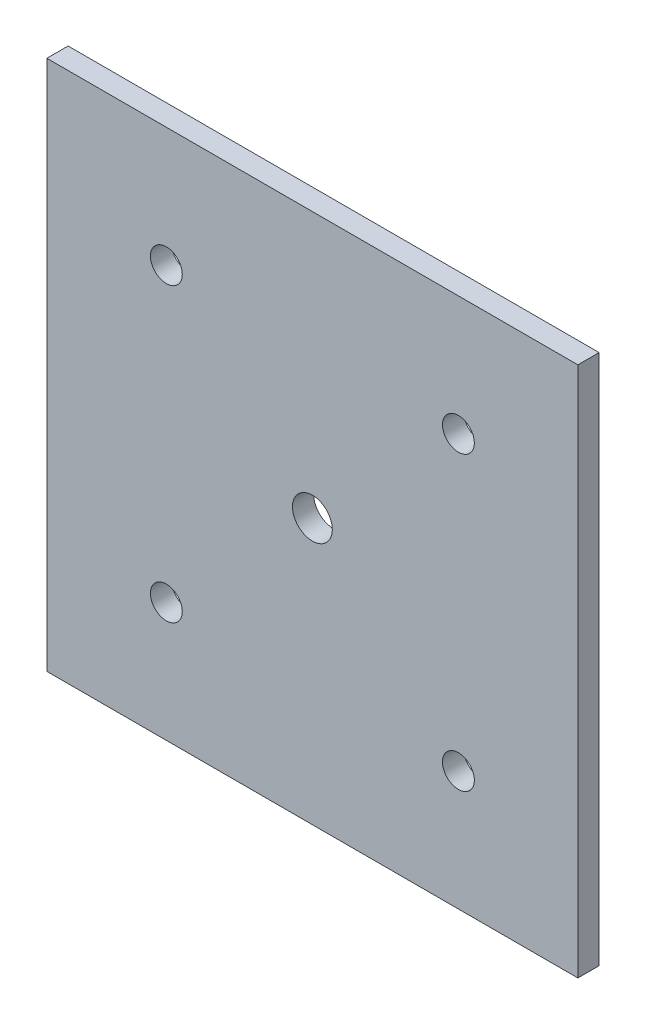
ISO-10303-21;
HEADER;
FILE_DESCRIPTION(('STEP AP214'),'2;1');
FILE_NAME('part.step','',(''),(''),'','','');
FILE_SCHEMA(('AUTOMOTIVE_DESIGN { 1 0 10303 214 1 1 1 1 }'));
ENDSEC;
DATA;
#1=APPLICATION_CONTEXT('core data for automotive mechanical design processes');
#2=APPLICATION_PROTOCOL_DEFINITION('international standard','automotive_design',2000,#1);
#3=PRODUCT_CONTEXT('',#1,'mechanical');
#4=PRODUCT('Part','Part','',(#3));
#5=PRODUCT_RELATED_PRODUCT_CATEGORY('part','',(#4));
#6=PRODUCT_DEFINITION_FORMATION('','',#4);
#7=PRODUCT_DEFINITION_CONTEXT('part definition',#1,'design');
#8=PRODUCT_DEFINITION('design','',#6,#7);
#9=PRODUCT_DEFINITION_SHAPE('','',#8);
#10=(LENGTH_UNIT() NAMED_UNIT(*) SI_UNIT(.MILLI.,.METRE.));
#11=(NAMED_UNIT(*) PLANE_ANGLE_UNIT() SI_UNIT($,.RADIAN.));
#12=(NAMED_UNIT(*) SI_UNIT($,.STERADIAN.) SOLID_ANGLE_UNIT());
#13=UNCERTAINTY_MEASURE_WITH_UNIT(LENGTH_MEASURE(1.E-05),#10,'distance_accuracy_value','');
#14=(GEOMETRIC_REPRESENTATION_CONTEXT(3) GLOBAL_UNCERTAINTY_ASSIGNED_CONTEXT((#13)) GLOBAL_UNIT_ASSIGNED_CONTEXT((#10,
#11,#12)) REPRESENTATION_CONTEXT('',''));
#15=CARTESIAN_POINT('',(0.,0.,0.));
#16=DIRECTION('',(0.,0.,1.));
#17=DIRECTION('',(1.,0.,0.));
#18=AXIS2_PLACEMENT_3D('',#15,#16,#17);
#19=CARTESIAN_POINT('',(100.,100.,8.));
#20=DIRECTION('',(0.,-1.,0.));
#21=DIRECTION('',(0.,0.,-1.));
#22=AXIS2_PLACEMENT_3D('',#19,#20,#21);
#23=PLANE('',#22);
#24=DIRECTION('',(-1.,0.,0.));
#25=VECTOR('',#24,1.);
#26=CARTESIAN_POINT('',(100.,100.,0.));
#27=LINE('',#26,#25);
#28=CARTESIAN_POINT('',(100.,100.,0.));
#29=VERTEX_POINT('',#28);
#30=CARTESIAN_POINT('',(-100.,100.,0.));
#31=VERTEX_POINT('',#30);
#32=EDGE_CURVE('E102',#29,#31,#27,.T.);
#33=ORIENTED_EDGE('',*,*,#32,.T.);
#34=DIRECTION('',(0.,0.,-1.));
#35=VECTOR('',#34,1.);
#36=CARTESIAN_POINT('',(-100.,100.,8.));
#37=LINE('',#36,#35);
#38=CARTESIAN_POINT('',(-100.,100.,8.));
#39=VERTEX_POINT('',#38);
#40=EDGE_CURVE('E11',#39,#31,#37,.T.);
#41=ORIENTED_EDGE('',*,*,#40,.F.);
#42=DIRECTION('',(-1.,0.,0.));
#43=VECTOR('',#42,1.);
#44=CARTESIAN_POINT('',(100.,100.,8.));
#45=LINE('',#44,#43);
#46=CARTESIAN_POINT('',(100.,100.,8.));
#47=VERTEX_POINT('',#46);
#48=EDGE_CURVE('E95',#47,#39,#45,.T.);
#49=ORIENTED_EDGE('',*,*,#48,.F.);
#50=DIRECTION('',(0.,0.,-1.));
#51=VECTOR('',#50,1.);
#52=CARTESIAN_POINT('',(100.,100.,8.));
#53=LINE('',#52,#51);
#54=EDGE_CURVE('E99',#47,#29,#53,.T.);
#55=ORIENTED_EDGE('',*,*,#54,.T.);
#56=EDGE_LOOP('',(#33,#41,#49,#55));
#57=FACE_BOUND('',#56,.T.);
#58=ADVANCED_FACE('F41',(#57),#23,.F.);
#59=CARTESIAN_POINT('',(-100.,-100.,8.));
#60=DIRECTION('',(1.,0.,0.));
#61=DIRECTION('',(0.,0.,-1.));
#62=AXIS2_PLACEMENT_3D('',#59,#60,#61);
#63=PLANE('',#62);
#64=DIRECTION('',(0.,-1.,0.));
#65=VECTOR('',#64,1.);
#66=CARTESIAN_POINT('',(-100.,-100.,0.));
#67=LINE('',#66,#65);
#68=CARTESIAN_POINT('',(-100.,-100.,0.));
#69=VERTEX_POINT('',#68);
#70=EDGE_CURVE('E96',#31,#69,#67,.T.);
#71=ORIENTED_EDGE('',*,*,#70,.T.);
#72=DIRECTION('',(0.,0.,-1.));
#73=VECTOR('',#72,1.);
#74=CARTESIAN_POINT('',(-100.,-100.,8.));
#75=LINE('',#74,#73);
#76=CARTESIAN_POINT('',(-100.,-100.,8.));
#77=VERTEX_POINT('',#76);
#78=EDGE_CURVE('E47',#77,#69,#75,.T.);
#79=ORIENTED_EDGE('',*,*,#78,.F.);
#80=DIRECTION('',(0.,-1.,0.));
#81=VECTOR('',#80,1.);
#82=CARTESIAN_POINT('',(-100.,-100.,8.));
#83=LINE('',#82,#81);
#84=EDGE_CURVE('E87',#39,#77,#83,.T.);
#85=ORIENTED_EDGE('',*,*,#84,.F.);
#86=ORIENTED_EDGE('',*,*,#40,.T.);
#87=EDGE_LOOP('',(#71,#79,#85,#86));
#88=FACE_BOUND('',#87,.T.);
#89=ADVANCED_FACE('F92',(#88),#63,.F.);
#90=CARTESIAN_POINT('',(100.,-100.,8.));
#91=DIRECTION('',(0.,1.,0.));
#92=DIRECTION('',(0.,0.,1.));
#93=AXIS2_PLACEMENT_3D('',#90,#91,#92);
#94=PLANE('',#93);
#95=DIRECTION('',(1.,0.,0.));
#96=VECTOR('',#95,1.);
#97=CARTESIAN_POINT('',(100.,-100.,0.));
#98=LINE('',#97,#96);
#99=CARTESIAN_POINT('',(100.,-100.,0.));
#100=VERTEX_POINT('',#99);
#101=EDGE_CURVE('E74',#69,#100,#98,.T.);
#102=ORIENTED_EDGE('',*,*,#101,.T.);
#103=DIRECTION('',(0.,0.,-1.));
#104=VECTOR('',#103,1.);
#105=CARTESIAN_POINT('',(100.,-100.,8.));
#106=LINE('',#105,#104);
#107=CARTESIAN_POINT('',(100.,-100.,8.));
#108=VERTEX_POINT('',#107);
#109=EDGE_CURVE('E100',#108,#100,#106,.T.);
#110=ORIENTED_EDGE('',*,*,#109,.F.);
#111=DIRECTION('',(1.,0.,0.));
#112=VECTOR('',#111,1.);
#113=CARTESIAN_POINT('',(100.,-100.,8.));
#114=LINE('',#113,#112);
#115=EDGE_CURVE('E89',#77,#108,#114,.T.);
#116=ORIENTED_EDGE('',*,*,#115,.F.);
#117=ORIENTED_EDGE('',*,*,#78,.T.);
#118=EDGE_LOOP('',(#102,#110,#116,#117));
#119=FACE_BOUND('',#118,.T.);
#120=ADVANCED_FACE('F98',(#119),#94,.F.);
#121=CARTESIAN_POINT('',(100.,-100.,8.));
#122=DIRECTION('',(-1.,0.,0.));
#123=DIRECTION('',(0.,0.,1.));
#124=AXIS2_PLACEMENT_3D('',#121,#122,#123);
#125=PLANE('',#124);
#126=DIRECTION('',(0.,1.,0.));
#127=VECTOR('',#126,1.);
#128=CARTESIAN_POINT('',(100.,-100.,0.));
#129=LINE('',#128,#127);
#130=EDGE_CURVE('E77',#100,#29,#129,.T.);
#131=ORIENTED_EDGE('',*,*,#130,.T.);
#132=ORIENTED_EDGE('',*,*,#54,.F.);
#133=DIRECTION('',(0.,1.,0.));
#134=VECTOR('',#133,1.);
#135=CARTESIAN_POINT('',(100.,-100.,8.));
#136=LINE('',#135,#134);
#137=EDGE_CURVE('E60',#108,#47,#136,.T.);
#138=ORIENTED_EDGE('',*,*,#137,.F.);
#139=ORIENTED_EDGE('',*,*,#109,.T.);
#140=EDGE_LOOP('',(#131,#132,#138,#139));
#141=FACE_BOUND('',#140,.T.);
#142=ADVANCED_FACE('F115',(#141),#125,.F.);
#143=CARTESIAN_POINT('',(0.,0.,8.));
#144=DIRECTION('',(0.,0.,-1.));
#145=DIRECTION('',(-1.,0.,0.));
#146=AXIS2_PLACEMENT_3D('',#143,#144,#145);
#147=PLANE('',#146);
#148=CARTESIAN_POINT('',(0.,0.,8.));
#149=DIRECTION('',(0.,0.,1.));
#150=DIRECTION('',(1.,0.,0.));
#151=AXIS2_PLACEMENT_3D('',#148,#149,#150);
#152=CIRCLE('',#151,7.5);
#153=CARTESIAN_POINT('',(7.5,0.,8.));
#154=VERTEX_POINT('',#153);
#155=EDGE_CURVE('E138',#154,#154,#152,.T.);
#156=ORIENTED_EDGE('',*,*,#155,.F.);
#157=EDGE_LOOP('',(#156));
#158=FACE_BOUND('',#157,.T.);
#159=CARTESIAN_POINT('',(-55.,55.,8.));
#160=DIRECTION('',(0.,0.,1.));
#161=DIRECTION('',(1.,0.,0.));
#162=AXIS2_PLACEMENT_3D('',#159,#160,#161);
#163=CIRCLE('',#162,6.);
#164=CARTESIAN_POINT('',(-49.,55.,8.));
#165=VERTEX_POINT('',#164);
#166=EDGE_CURVE('E133',#165,#165,#163,.T.);
#167=ORIENTED_EDGE('',*,*,#166,.F.);
#168=EDGE_LOOP('',(#167));
#169=FACE_BOUND('',#168,.T.);
#170=CARTESIAN_POINT('',(55.,-55.,8.));
#171=DIRECTION('',(0.,0.,1.));
#172=DIRECTION('',(1.,0.,0.));
#173=AXIS2_PLACEMENT_3D('',#170,#171,#172);
#174=CIRCLE('',#173,6.);
#175=CARTESIAN_POINT('',(61.,-55.,8.));
#176=VERTEX_POINT('',#175);
#177=EDGE_CURVE('E123',#176,#176,#174,.T.);
#178=ORIENTED_EDGE('',*,*,#177,.F.);
#179=EDGE_LOOP('',(#178));
#180=FACE_BOUND('',#179,.T.);
#181=CARTESIAN_POINT('',(55.,55.,8.));
#182=DIRECTION('',(0.,0.,1.));
#183=DIRECTION('',(1.,0.,0.));
#184=AXIS2_PLACEMENT_3D('',#181,#182,#183);
#185=CIRCLE('',#184,6.);
#186=CARTESIAN_POINT('',(61.,55.,8.));
#187=VERTEX_POINT('',#186);
#188=EDGE_CURVE('E136',#187,#187,#185,.T.);
#189=ORIENTED_EDGE('',*,*,#188,.F.);
#190=EDGE_LOOP('',(#189));
#191=FACE_BOUND('',#190,.T.);
#192=CARTESIAN_POINT('',(-55.,-55.,8.));
#193=DIRECTION('',(0.,0.,1.));
#194=DIRECTION('',(1.,0.,0.));
#195=AXIS2_PLACEMENT_3D('',#192,#193,#194);
#196=CIRCLE('',#195,6.);
#197=CARTESIAN_POINT('',(-49.,-55.,8.));
#198=VERTEX_POINT('',#197);
#199=EDGE_CURVE('E110',#198,#198,#196,.T.);
#200=ORIENTED_EDGE('',*,*,#199,.F.);
#201=EDGE_LOOP('',(#200));
#202=FACE_BOUND('',#201,.T.);
#203=ORIENTED_EDGE('',*,*,#48,.T.);
#204=ORIENTED_EDGE('',*,*,#84,.T.);
#205=ORIENTED_EDGE('',*,*,#115,.T.);
#206=ORIENTED_EDGE('',*,*,#137,.T.);
#207=EDGE_LOOP('',(#203,#204,#205,#206));
#208=FACE_BOUND('',#207,.T.);
#209=ADVANCED_FACE('F86',(#158,#169,#180,#191,#202,#208),#147,.F.);
#210=CARTESIAN_POINT('',(0.,0.,0.));
#211=DIRECTION('',(0.,0.,-1.));
#212=DIRECTION('',(-1.,0.,0.));
#213=AXIS2_PLACEMENT_3D('',#210,#211,#212);
#214=PLANE('',#213);
#215=CARTESIAN_POINT('',(0.,0.,0.));
#216=DIRECTION('',(0.,0.,1.));
#217=DIRECTION('',(1.,0.,0.));
#218=AXIS2_PLACEMENT_3D('',#215,#216,#217);
#219=CIRCLE('',#218,7.5);
#220=CARTESIAN_POINT('',(7.5,0.,0.));
#221=VERTEX_POINT('',#220);
#222=EDGE_CURVE('E142',#221,#221,#219,.T.);
#223=ORIENTED_EDGE('',*,*,#222,.T.);
#224=EDGE_LOOP('',(#223));
#225=FACE_BOUND('',#224,.T.);
#226=CARTESIAN_POINT('',(-55.,55.,0.));
#227=DIRECTION('',(0.,0.,1.));
#228=DIRECTION('',(1.,0.,0.));
#229=AXIS2_PLACEMENT_3D('',#226,#227,#228);
#230=CIRCLE('',#229,6.);
#231=CARTESIAN_POINT('',(-49.,55.,0.));
#232=VERTEX_POINT('',#231);
#233=EDGE_CURVE('E121',#232,#232,#230,.T.);
#234=ORIENTED_EDGE('',*,*,#233,.T.);
#235=EDGE_LOOP('',(#234));
#236=FACE_BOUND('',#235,.T.);
#237=CARTESIAN_POINT('',(55.,-55.,0.));
#238=DIRECTION('',(0.,0.,1.));
#239=DIRECTION('',(1.,0.,0.));
#240=AXIS2_PLACEMENT_3D('',#237,#238,#239);
#241=CIRCLE('',#240,6.);
#242=CARTESIAN_POINT('',(61.,-55.,0.));
#243=VERTEX_POINT('',#242);
#244=EDGE_CURVE('E130',#243,#243,#241,.T.);
#245=ORIENTED_EDGE('',*,*,#244,.T.);
#246=EDGE_LOOP('',(#245));
#247=FACE_BOUND('',#246,.T.);
#248=CARTESIAN_POINT('',(55.,55.,0.));
#249=DIRECTION('',(0.,0.,1.));
#250=DIRECTION('',(1.,0.,0.));
#251=AXIS2_PLACEMENT_3D('',#248,#249,#250);
#252=CIRCLE('',#251,6.);
#253=CARTESIAN_POINT('',(61.,55.,0.));
#254=VERTEX_POINT('',#253);
#255=EDGE_CURVE('E126',#254,#254,#252,.T.);
#256=ORIENTED_EDGE('',*,*,#255,.T.);
#257=EDGE_LOOP('',(#256));
#258=FACE_BOUND('',#257,.T.);
#259=CARTESIAN_POINT('',(-55.,-55.,0.));
#260=DIRECTION('',(0.,0.,1.));
#261=DIRECTION('',(1.,0.,0.));
#262=AXIS2_PLACEMENT_3D('',#259,#260,#261);
#263=CIRCLE('',#262,6.);
#264=CARTESIAN_POINT('',(-49.,-55.,0.));
#265=VERTEX_POINT('',#264);
#266=EDGE_CURVE('E116',#265,#265,#263,.T.);
#267=ORIENTED_EDGE('',*,*,#266,.T.);
#268=EDGE_LOOP('',(#267));
#269=FACE_BOUND('',#268,.T.);
#270=ORIENTED_EDGE('',*,*,#32,.F.);
#271=ORIENTED_EDGE('',*,*,#130,.F.);
#272=ORIENTED_EDGE('',*,*,#101,.F.);
#273=ORIENTED_EDGE('',*,*,#70,.F.);
#274=EDGE_LOOP('',(#270,#271,#272,#273));
#275=FACE_BOUND('',#274,.T.);
#276=ADVANCED_FACE('F113',(#225,#236,#247,#258,#269,#275),#214,.T.);
#277=CARTESIAN_POINT('',(-55.,-55.,8.));
#278=DIRECTION('',(0.,0.,-1.));
#279=DIRECTION('',(-1.,0.,0.));
#280=AXIS2_PLACEMENT_3D('',#277,#278,#279);
#281=CYLINDRICAL_SURFACE('',#280,6.);
#282=ORIENTED_EDGE('',*,*,#199,.T.);
#283=EDGE_LOOP('',(#282));
#284=FACE_BOUND('',#283,.T.);
#285=ORIENTED_EDGE('',*,*,#266,.F.);
#286=EDGE_LOOP('',(#285));
#287=FACE_BOUND('',#286,.T.);
#288=ADVANCED_FACE('F165',(#284,#287),#281,.F.);
#289=CARTESIAN_POINT('',(55.,55.,8.));
#290=DIRECTION('',(0.,0.,-1.));
#291=DIRECTION('',(-1.,0.,0.));
#292=AXIS2_PLACEMENT_3D('',#289,#290,#291);
#293=CYLINDRICAL_SURFACE('',#292,6.);
#294=ORIENTED_EDGE('',*,*,#188,.T.);
#295=EDGE_LOOP('',(#294));
#296=FACE_BOUND('',#295,.T.);
#297=ORIENTED_EDGE('',*,*,#255,.F.);
#298=EDGE_LOOP('',(#297));
#299=FACE_BOUND('',#298,.T.);
#300=ADVANCED_FACE('F164',(#296,#299),#293,.F.);
#301=CARTESIAN_POINT('',(55.,-55.,8.));
#302=DIRECTION('',(0.,0.,-1.));
#303=DIRECTION('',(-1.,0.,0.));
#304=AXIS2_PLACEMENT_3D('',#301,#302,#303);
#305=CYLINDRICAL_SURFACE('',#304,6.);
#306=ORIENTED_EDGE('',*,*,#177,.T.);
#307=EDGE_LOOP('',(#306));
#308=FACE_BOUND('',#307,.T.);
#309=ORIENTED_EDGE('',*,*,#244,.F.);
#310=EDGE_LOOP('',(#309));
#311=FACE_BOUND('',#310,.T.);
#312=ADVANCED_FACE('F201',(#308,#311),#305,.F.);
#313=CARTESIAN_POINT('',(-55.,55.,8.));
#314=DIRECTION('',(0.,0.,-1.));
#315=DIRECTION('',(-1.,0.,0.));
#316=AXIS2_PLACEMENT_3D('',#313,#314,#315);
#317=CYLINDRICAL_SURFACE('',#316,6.);
#318=ORIENTED_EDGE('',*,*,#166,.T.);
#319=EDGE_LOOP('',(#318));
#320=FACE_BOUND('',#319,.T.);
#321=ORIENTED_EDGE('',*,*,#233,.F.);
#322=EDGE_LOOP('',(#321));
#323=FACE_BOUND('',#322,.T.);
#324=ADVANCED_FACE('F215',(#320,#323),#317,.F.);
#325=CARTESIAN_POINT('',(0.,0.,8.));
#326=DIRECTION('',(0.,0.,-1.));
#327=DIRECTION('',(-1.,0.,0.));
#328=AXIS2_PLACEMENT_3D('',#325,#326,#327);
#329=CYLINDRICAL_SURFACE('',#328,7.5);
#330=ORIENTED_EDGE('',*,*,#155,.T.);
#331=EDGE_LOOP('',(#330));
#332=FACE_BOUND('',#331,.T.);
#333=ORIENTED_EDGE('',*,*,#222,.F.);
#334=EDGE_LOOP('',(#333));
#335=FACE_BOUND('',#334,.T.);
#336=ADVANCED_FACE('F146',(#332,#335),#329,.F.);
#337=CLOSED_SHELL('',(#58,#89,#120,#142,#209,#276,#288,#300,#312,#324,#336));
#338=MANIFOLD_SOLID_BREP('B2',#337);
#339=ADVANCED_BREP_SHAPE_REPRESENTATION('',(#18,#338),#14);
#340=SHAPE_DEFINITION_REPRESENTATION(#9,#339);
ENDSEC;
END-ISO-10303-21;
